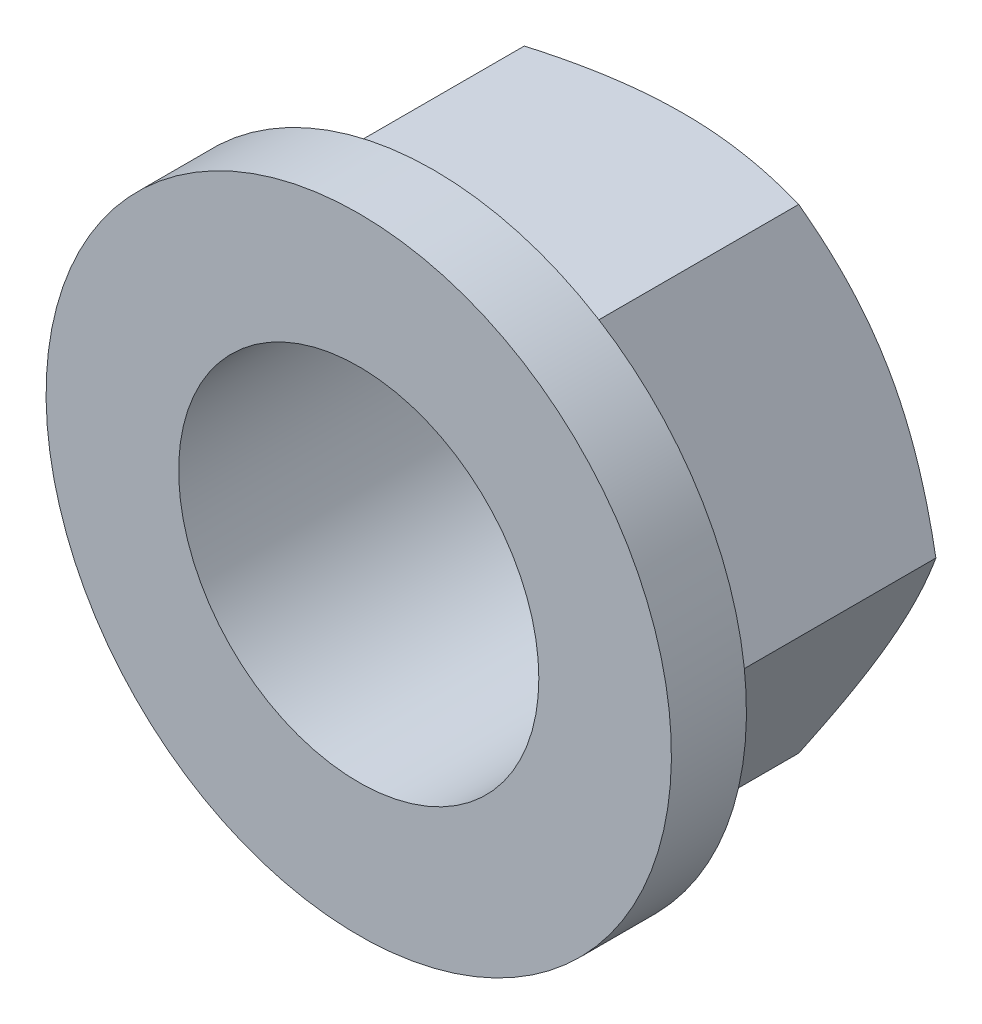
from build123d import *

# Parameters (mm, degrees)
BASE_EXTRUSION_DEPTH    = 5.4
ESQUISSE4_R             = 7.2
ENL_V_MAT_EXTRU_1_DEPTH = 19.089315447
ESQUISSE6_W             = 3
ESQUISSE6_H             = 12.5
ESQUISSE7_R             = 7.2
ENL_V_MAT_EXTRU_2_DEPTH = 21.28625735


with BuildPart() as part:
    # Esquisse1 → Base-Extrusion (new, symmetric)
    with BuildSketch(Plane.XY):
        Polygon((5.484827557, -9.5), (10.969655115, 0), (5.484827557, 9.5), (-5.484827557, 9.5), (-10.969655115, 0), (-5.484827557, -9.5), align=None)
    extrude(amount=BASE_EXTRUSION_DEPTH, both=True)

    # Esquisse4 → Enl_v. mat.-Extru.1 (cut, through all)
    with BuildSketch(Plane.XY.offset(5.4)):
        Circle(ESQUISSE4_R)
    extrude(amount=-ENL_V_MAT_EXTRU_1_DEPTH, mode=Mode.SUBTRACT)

    # Esquisse5 → Enl_vement de mati_re-R_volution1 (revolve, cut)
    with BuildSketch(Plane(origin=(0, 0, 0), x_dir=(0, 0, -1), z_dir=(1, 0, 0))):
        Polygon((5.4, -9.5), (-5.4, -28.206148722), (5.4, -28.206148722), align=None)
    enl_vement_de_mati_re_r_volution1 = revolve(axis=Axis((0, 0, 0), (0, 0, 1)), mode=Mode.SUBTRACT)

    # Sym_trie1: Enl_vement de mati_re-R_volution1 across plane
    add(enl_vement_de_mati_re_r_volution1.mirror(Plane.XY), mode=Mode.SUBTRACT)

    # Esquisse6 → R_volution1 (revolve)
    with BuildSketch(Plane(origin=(0, 0, 0), x_dir=(0, 0, -1), z_dir=(1, 0, 0))):
        with Locations((-6.051494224, 6.25)):
            Rectangle(ESQUISSE6_W, ESQUISSE6_H)
    revolve(axis=Axis((0, 0, 0), (0, 0, 1)))

    # Esquisse7 → Enl_v. mat.-Extru.2 (cut, through all)
    with BuildSketch(Plane(origin=(0, 0, 4.551494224), x_dir=(-1, 0, 0), z_dir=(0, 0, -1))):
        with Locations(Location((0, 0, 0), (0, 0, 180))):
            Circle(ESQUISSE7_R)
    extrude(amount=-ENL_V_MAT_EXTRU_2_DEPTH, mode=Mode.SUBTRACT)


solid = part.part
